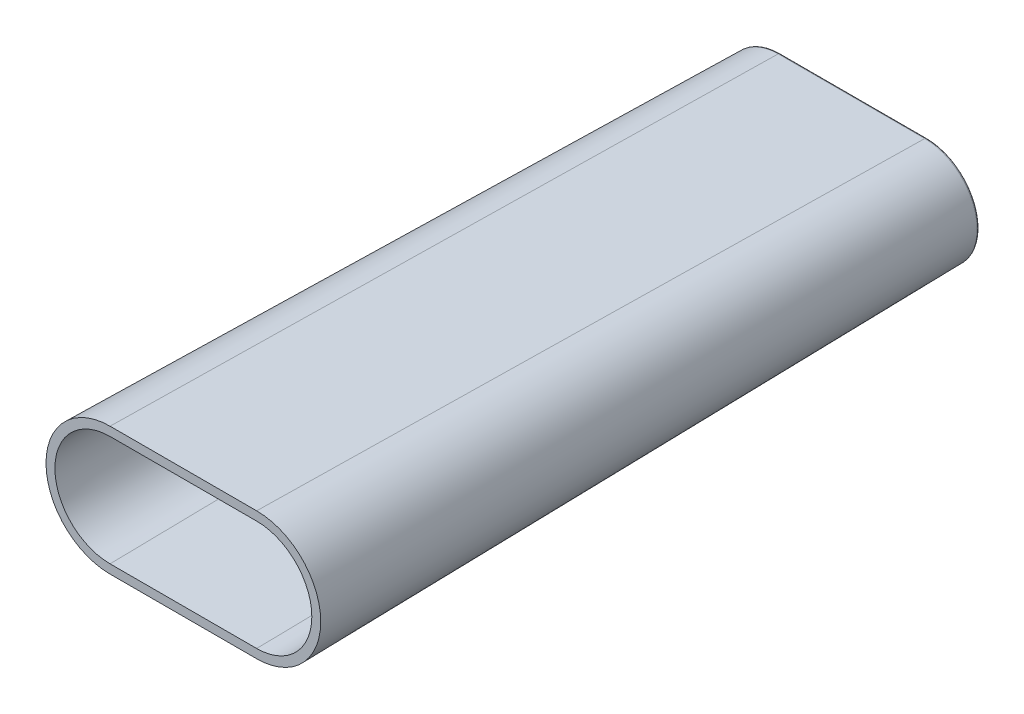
ISO-10303-21;
HEADER;
FILE_DESCRIPTION(('STEP AP214'),'2;1');
FILE_NAME('part.step','',(''),(''),'','','');
FILE_SCHEMA(('AUTOMOTIVE_DESIGN { 1 0 10303 214 1 1 1 1 }'));
ENDSEC;
DATA;
#1=APPLICATION_CONTEXT('core data for automotive mechanical design processes');
#2=APPLICATION_PROTOCOL_DEFINITION('international standard','automotive_design',2000,#1);
#3=PRODUCT_CONTEXT('',#1,'mechanical');
#4=PRODUCT('Part','Part','',(#3));
#5=PRODUCT_RELATED_PRODUCT_CATEGORY('part','',(#4));
#6=PRODUCT_DEFINITION_FORMATION('','',#4);
#7=PRODUCT_DEFINITION_CONTEXT('part definition',#1,'design');
#8=PRODUCT_DEFINITION('design','',#6,#7);
#9=PRODUCT_DEFINITION_SHAPE('','',#8);
#10=(LENGTH_UNIT() NAMED_UNIT(*) SI_UNIT(.MILLI.,.METRE.));
#11=(NAMED_UNIT(*) PLANE_ANGLE_UNIT() SI_UNIT($,.RADIAN.));
#12=(NAMED_UNIT(*) SI_UNIT($,.STERADIAN.) SOLID_ANGLE_UNIT());
#13=UNCERTAINTY_MEASURE_WITH_UNIT(LENGTH_MEASURE(1.E-05),#10,'distance_accuracy_value','');
#14=(GEOMETRIC_REPRESENTATION_CONTEXT(3) GLOBAL_UNCERTAINTY_ASSIGNED_CONTEXT((#13)) GLOBAL_UNIT_ASSIGNED_CONTEXT((#10,
#11,#12)) REPRESENTATION_CONTEXT('',''));
#15=CARTESIAN_POINT('',(0.,0.,0.));
#16=DIRECTION('',(0.,0.,1.));
#17=DIRECTION('',(1.,0.,0.));
#18=AXIS2_PLACEMENT_3D('',#15,#16,#17);
#19=CARTESIAN_POINT('',(-7.,-4.15012945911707,0.014834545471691));
#20=DIRECTION('',(0.,-0.999847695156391,-0.0174524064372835));
#21=DIRECTION('',(0.,0.0174524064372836,-0.999847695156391));
#22=AXIS2_PLACEMENT_3D('',#19,#20,#21);
#23=PLANE('',#22);
#24=DIRECTION('',(-1.,0.,0.));
#25=VECTOR('',#24,1.);
#26=CARTESIAN_POINT('',(-0.500000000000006,-5.00242283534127,48.8426893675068));
#27=LINE('',#26,#25);
#28=CARTESIAN_POINT('',(-0.500000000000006,-5.00242283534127,48.8426893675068));
#29=VERTEX_POINT('',#28);
#30=CARTESIAN_POINT('',(0.499999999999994,-5.00242283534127,48.8426893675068));
#31=VERTEX_POINT('',#30);
#32=EDGE_CURVE('E169',#29,#31,#27,.F.);
#33=ORIENTED_EDGE('',*,*,#32,.F.);
#34=DIRECTION('',(0.,0.0174524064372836,-0.999847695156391));
#35=VECTOR('',#34,1.);
#36=CARTESIAN_POINT('',(-0.500000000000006,-5.01679211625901,49.6659049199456));
#37=LINE('',#36,#35);
#38=CARTESIAN_POINT('',(-0.5,-4.16470732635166,0.849999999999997));
#39=VERTEX_POINT('',#38);
#40=EDGE_CURVE('E170',#39,#29,#37,.F.);
#41=ORIENTED_EDGE('',*,*,#40,.F.);
#42=DIRECTION('',(-1.,0.,0.));
#43=VECTOR('',#42,1.);
#44=CARTESIAN_POINT('',(-7.,-4.16470732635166,0.85));
#45=LINE('',#44,#43);
#46=CARTESIAN_POINT('',(-7.,-4.16470732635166,0.85));
#47=VERTEX_POINT('',#46);
#48=EDGE_CURVE('E217',#47,#39,#45,.F.);
#49=ORIENTED_EDGE('',*,*,#48,.F.);
#50=DIRECTION('',(0.,0.0174524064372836,-0.999847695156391));
#51=VECTOR('',#50,1.);
#52=CARTESIAN_POINT('',(-7.,-4.15012945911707,0.014834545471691));
#53=LINE('',#52,#51);
#54=CARTESIAN_POINT('',(-7.,-5.26699467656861,64.));
#55=VERTEX_POINT('',#54);
#56=EDGE_CURVE('E207',#55,#47,#53,.T.);
#57=ORIENTED_EDGE('',*,*,#56,.F.);
#58=DIRECTION('',(-1.,0.,0.));
#59=VECTOR('',#58,1.);
#60=CARTESIAN_POINT('',(-7.,-5.26699467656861,64.));
#61=LINE('',#60,#59);
#62=CARTESIAN_POINT('',(7.,-5.26699467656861,64.));
#63=VERTEX_POINT('',#62);
#64=EDGE_CURVE('E231',#55,#63,#61,.F.);
#65=ORIENTED_EDGE('',*,*,#64,.T.);
#66=DIRECTION('',(0.,-0.0174524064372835,0.999847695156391));
#67=VECTOR('',#66,1.);
#68=CARTESIAN_POINT('',(7.,-4.15012945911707,0.014834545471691));
#69=LINE('',#68,#67);
#70=CARTESIAN_POINT('',(7.,-4.16470732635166,0.85));
#71=VERTEX_POINT('',#70);
#72=EDGE_CURVE('E211',#63,#71,#69,.F.);
#73=ORIENTED_EDGE('',*,*,#72,.T.);
#74=CARTESIAN_POINT('',(0.5,-4.16470732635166,0.85));
#75=VERTEX_POINT('',#74);
#76=EDGE_CURVE('E206',#75,#71,#45,.F.);
#77=ORIENTED_EDGE('',*,*,#76,.F.);
#78=DIRECTION('',(0.,-0.0174524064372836,0.999847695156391));
#79=VECTOR('',#78,1.);
#80=CARTESIAN_POINT('',(0.5,-4.17958692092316,1.70245140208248));
#81=LINE('',#80,#79);
#82=EDGE_CURVE('E52',#31,#75,#81,.F.);
#83=ORIENTED_EDGE('',*,*,#82,.F.);
#84=EDGE_LOOP('',(#33,#41,#49,#57,#65,#73,#77,#83));
#85=FACE_BOUND('',#84,.T.);
#86=ADVANCED_FACE('F35',(#85),#23,.F.);
#87=CARTESIAN_POINT('',(7.,4.15012945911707,0.014834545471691));
#88=DIRECTION('',(0.,0.999847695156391,-0.0174524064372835));
#89=DIRECTION('',(0.,0.0174524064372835,0.999847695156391));
#90=AXIS2_PLACEMENT_3D('',#87,#88,#89);
#91=PLANE('',#90);
#92=DIRECTION('',(1.,0.,0.));
#93=VECTOR('',#92,1.);
#94=CARTESIAN_POINT('',(7.,4.16470732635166,0.85));
#95=LINE('',#94,#93);
#96=CARTESIAN_POINT('',(-0.5,4.16470732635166,0.849999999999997));
#97=VERTEX_POINT('',#96);
#98=CARTESIAN_POINT('',(-7.,4.16470732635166,0.85));
#99=VERTEX_POINT('',#98);
#100=EDGE_CURVE('E224',#97,#99,#95,.F.);
#101=ORIENTED_EDGE('',*,*,#100,.F.);
#102=DIRECTION('',(0.,-0.0174524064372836,-0.999847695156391));
#103=VECTOR('',#102,1.);
#104=CARTESIAN_POINT('',(-0.500000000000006,5.00242283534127,48.8426893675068));
#105=LINE('',#104,#103);
#106=CARTESIAN_POINT('',(-0.500000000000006,5.00242283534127,48.8426893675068));
#107=VERTEX_POINT('',#106);
#108=EDGE_CURVE('E183',#107,#97,#105,.T.);
#109=ORIENTED_EDGE('',*,*,#108,.F.);
#110=DIRECTION('',(-1.,0.,0.));
#111=VECTOR('',#110,1.);
#112=CARTESIAN_POINT('',(-0.500000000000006,5.00242283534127,48.8426893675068));
#113=LINE('',#112,#111);
#114=CARTESIAN_POINT('',(0.499999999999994,5.00242283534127,48.8426893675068));
#115=VERTEX_POINT('',#114);
#116=EDGE_CURVE('E166',#115,#107,#113,.T.);
#117=ORIENTED_EDGE('',*,*,#116,.F.);
#118=DIRECTION('',(0.,0.0174524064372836,0.999847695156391));
#119=VECTOR('',#118,1.);
#120=CARTESIAN_POINT('',(0.5,4.16470732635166,0.849999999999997));
#121=LINE('',#120,#119);
#122=CARTESIAN_POINT('',(0.5,4.16470732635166,0.849999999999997));
#123=VERTEX_POINT('',#122);
#124=EDGE_CURVE('E174',#123,#115,#121,.T.);
#125=ORIENTED_EDGE('',*,*,#124,.F.);
#126=CARTESIAN_POINT('',(7.,4.16470732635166,0.85));
#127=VERTEX_POINT('',#126);
#128=EDGE_CURVE('E227',#127,#123,#95,.F.);
#129=ORIENTED_EDGE('',*,*,#128,.F.);
#130=DIRECTION('',(0.,0.0174524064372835,0.999847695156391));
#131=VECTOR('',#130,1.);
#132=CARTESIAN_POINT('',(7.,4.15012945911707,0.014834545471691));
#133=LINE('',#132,#131);
#134=CARTESIAN_POINT('',(7.,5.26699467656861,64.));
#135=VERTEX_POINT('',#134);
#136=EDGE_CURVE('E215',#135,#127,#133,.F.);
#137=ORIENTED_EDGE('',*,*,#136,.F.);
#138=DIRECTION('',(1.,0.,0.));
#139=VECTOR('',#138,1.);
#140=CARTESIAN_POINT('',(7.,5.26699467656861,64.));
#141=LINE('',#140,#139);
#142=CARTESIAN_POINT('',(-7.,5.26699467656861,64.));
#143=VERTEX_POINT('',#142);
#144=EDGE_CURVE('E216',#135,#143,#141,.F.);
#145=ORIENTED_EDGE('',*,*,#144,.T.);
#146=DIRECTION('',(0.,0.0174524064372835,0.999847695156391));
#147=VECTOR('',#146,1.);
#148=CARTESIAN_POINT('',(-7.,4.15012945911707,0.014834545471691));
#149=LINE('',#148,#147);
#150=EDGE_CURVE('E212',#143,#99,#149,.F.);
#151=ORIENTED_EDGE('',*,*,#150,.T.);
#152=EDGE_LOOP('',(#101,#109,#117,#125,#129,#137,#145,#151));
#153=FACE_BOUND('',#152,.T.);
#154=ADVANCED_FACE('F182',(#153),#91,.F.);
#155=CARTESIAN_POINT('',(-7.,0.,0.85));
#156=DIRECTION('',(0.,0.,1.));
#157=DIRECTION('',(1.,0.,0.));
#158=AXIS2_PLACEMENT_3D('',#155,#156,#157);
#159=PLANE('',#158);
#160=ORIENTED_EDGE('',*,*,#48,.T.);
#161=DIRECTION('',(0.,1.,0.));
#162=VECTOR('',#161,1.);
#163=CARTESIAN_POINT('',(-0.5,-53.0164950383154,0.849999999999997));
#164=LINE('',#163,#162);
#165=EDGE_CURVE('E189',#39,#97,#164,.T.);
#166=ORIENTED_EDGE('',*,*,#165,.T.);
#167=ORIENTED_EDGE('',*,*,#100,.T.);
#168=CARTESIAN_POINT('',(-7.,0.,0.85));
#169=DIRECTION('',(0.,0.,1.));
#170=DIRECTION('',(1.,0.,0.));
#171=AXIS2_PLACEMENT_3D('',#168,#169,#170);
#172=CIRCLE('',#171,4.16470732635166);
#173=EDGE_CURVE('E203',#99,#47,#172,.T.);
#174=ORIENTED_EDGE('',*,*,#173,.T.);
#175=EDGE_LOOP('',(#160,#166,#167,#174));
#176=FACE_BOUND('',#175,.T.);
#177=ADVANCED_FACE('F339',(#176),#159,.T.);
#178=ORIENTED_EDGE('',*,*,#128,.T.);
#179=DIRECTION('',(0.,1.,0.));
#180=VECTOR('',#179,1.);
#181=CARTESIAN_POINT('',(0.5,-53.0164950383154,0.849999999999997));
#182=LINE('',#181,#180);
#183=EDGE_CURVE('E176',#75,#123,#182,.T.);
#184=ORIENTED_EDGE('',*,*,#183,.F.);
#185=ORIENTED_EDGE('',*,*,#76,.T.);
#186=CARTESIAN_POINT('',(7.,0.,0.85));
#187=DIRECTION('',(0.,0.,1.));
#188=DIRECTION('',(1.,0.,0.));
#189=AXIS2_PLACEMENT_3D('',#186,#187,#188);
#190=CIRCLE('',#189,4.16470732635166);
#191=EDGE_CURVE('E220',#71,#127,#190,.T.);
#192=ORIENTED_EDGE('',*,*,#191,.T.);
#193=EDGE_LOOP('',(#178,#184,#185,#192));
#194=FACE_BOUND('',#193,.T.);
#195=ADVANCED_FACE('F344',(#194),#159,.T.);
#196=CARTESIAN_POINT('',(-7.,0.,0.));
#197=DIRECTION('',(0.,0.,1.));
#198=DIRECTION('',(1.,0.,0.));
#199=AXIS2_PLACEMENT_3D('',#196,#197,#198);
#200=CONICAL_SURFACE('',#199,5.,0.0174532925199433);
#201=DIRECTION('',(0.,0.0174524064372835,0.999847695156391));
#202=VECTOR('',#201,1.);
#203=CARTESIAN_POINT('',(-7.,5.,0.));
#204=LINE('',#203,#202);
#205=CARTESIAN_POINT('',(-7.,6.11712415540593,64.));
#206=VERTEX_POINT('',#205);
#207=CARTESIAN_POINT('',(-7.,5.00343008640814,0.196509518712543));
#208=VERTEX_POINT('',#207);
#209=EDGE_CURVE('E245',#206,#208,#204,.F.);
#210=ORIENTED_EDGE('',*,*,#209,.T.);
#211=CARTESIAN_POINT('',(-7.,0.,0.196509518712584));
#212=DIRECTION('',(0.,0.,-1.));
#213=DIRECTION('',(-1.,0.,0.));
#214=AXIS2_PLACEMENT_3D('',#211,#212,#213);
#215=CIRCLE('',#214,5.00343008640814);
#216=CARTESIAN_POINT('',(-7.,-5.00343008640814,0.196509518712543));
#217=VERTEX_POINT('',#216);
#218=EDGE_CURVE('E11',#208,#217,#215,.F.);
#219=ORIENTED_EDGE('',*,*,#218,.T.);
#220=DIRECTION('',(0.,-0.0174524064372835,0.999847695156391));
#221=VECTOR('',#220,1.);
#222=CARTESIAN_POINT('',(-7.,-5.,0.));
#223=LINE('',#222,#221);
#224=CARTESIAN_POINT('',(-7.,-6.11712415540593,64.));
#225=VERTEX_POINT('',#224);
#226=EDGE_CURVE('E246',#225,#217,#223,.F.);
#227=ORIENTED_EDGE('',*,*,#226,.F.);
#228=CARTESIAN_POINT('',(-7.,0.,64.));
#229=DIRECTION('',(0.,0.,1.));
#230=DIRECTION('',(1.,0.,0.));
#231=AXIS2_PLACEMENT_3D('',#228,#229,#230);
#232=CIRCLE('',#231,6.11712415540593);
#233=EDGE_CURVE('E210',#206,#225,#232,.T.);
#234=ORIENTED_EDGE('',*,*,#233,.F.);
#235=EDGE_LOOP('',(#210,#219,#227,#234));
#236=FACE_BOUND('',#235,.T.);
#237=ADVANCED_FACE('F354',(#236),#200,.T.);
#238=CARTESIAN_POINT('',(-7.,-5.,0.));
#239=DIRECTION('',(0.,-0.999847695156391,-0.0174524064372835));
#240=DIRECTION('',(0.,0.0174524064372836,-0.999847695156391));
#241=AXIS2_PLACEMENT_3D('',#238,#239,#240);
#242=PLANE('',#241);
#243=ORIENTED_EDGE('',*,*,#226,.T.);
#244=DIRECTION('',(1.,0.,0.));
#245=VECTOR('',#244,1.);
#246=CARTESIAN_POINT('',(-7.,-5.00343008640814,0.196509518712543));
#247=LINE('',#246,#245);
#248=CARTESIAN_POINT('',(7.,-5.00343008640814,0.196509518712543));
#249=VERTEX_POINT('',#248);
#250=EDGE_CURVE('E249',#217,#249,#247,.T.);
#251=ORIENTED_EDGE('',*,*,#250,.T.);
#252=DIRECTION('',(0.,-0.0174524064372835,0.999847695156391));
#253=VECTOR('',#252,1.);
#254=CARTESIAN_POINT('',(7.,-5.,0.));
#255=LINE('',#254,#253);
#256=CARTESIAN_POINT('',(7.,-6.11712415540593,64.));
#257=VERTEX_POINT('',#256);
#258=EDGE_CURVE('E250',#257,#249,#255,.F.);
#259=ORIENTED_EDGE('',*,*,#258,.F.);
#260=DIRECTION('',(-1.,0.,0.));
#261=VECTOR('',#260,1.);
#262=CARTESIAN_POINT('',(-7.,-6.11712415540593,64.));
#263=LINE('',#262,#261);
#264=EDGE_CURVE('E239',#225,#257,#263,.F.);
#265=ORIENTED_EDGE('',*,*,#264,.F.);
#266=EDGE_LOOP('',(#243,#251,#259,#265));
#267=FACE_BOUND('',#266,.T.);
#268=ADVANCED_FACE('F357',(#267),#242,.T.);
#269=CARTESIAN_POINT('',(7.,0.,0.));
#270=DIRECTION('',(0.,0.,1.));
#271=DIRECTION('',(-1.,0.,0.));
#272=AXIS2_PLACEMENT_3D('',#269,#270,#271);
#273=CONICAL_SURFACE('',#272,5.,0.0174532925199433);
#274=ORIENTED_EDGE('',*,*,#258,.T.);
#275=CARTESIAN_POINT('',(7.,0.,0.196509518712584));
#276=DIRECTION('',(0.,0.,-1.));
#277=DIRECTION('',(-1.,0.,0.));
#278=AXIS2_PLACEMENT_3D('',#275,#276,#277);
#279=CIRCLE('',#278,5.00343008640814);
#280=CARTESIAN_POINT('',(7.,5.00343008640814,0.196509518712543));
#281=VERTEX_POINT('',#280);
#282=EDGE_CURVE('E276',#249,#281,#279,.F.);
#283=ORIENTED_EDGE('',*,*,#282,.T.);
#284=DIRECTION('',(0.,0.0174524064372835,0.999847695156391));
#285=VECTOR('',#284,1.);
#286=CARTESIAN_POINT('',(7.,5.,0.));
#287=LINE('',#286,#285);
#288=CARTESIAN_POINT('',(7.,6.11712415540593,64.));
#289=VERTEX_POINT('',#288);
#290=EDGE_CURVE('E252',#289,#281,#287,.F.);
#291=ORIENTED_EDGE('',*,*,#290,.F.);
#292=CARTESIAN_POINT('',(7.,0.,64.));
#293=DIRECTION('',(0.,0.,1.));
#294=DIRECTION('',(1.,0.,0.));
#295=AXIS2_PLACEMENT_3D('',#292,#293,#294);
#296=CIRCLE('',#295,6.11712415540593);
#297=EDGE_CURVE('E241',#257,#289,#296,.T.);
#298=ORIENTED_EDGE('',*,*,#297,.F.);
#299=EDGE_LOOP('',(#274,#283,#291,#298));
#300=FACE_BOUND('',#299,.T.);
#301=ADVANCED_FACE('F361',(#300),#273,.T.);
#302=CARTESIAN_POINT('',(7.,5.,0.));
#303=DIRECTION('',(0.,0.999847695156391,-0.0174524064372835));
#304=DIRECTION('',(0.,0.0174524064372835,0.999847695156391));
#305=AXIS2_PLACEMENT_3D('',#302,#303,#304);
#306=PLANE('',#305);
#307=ORIENTED_EDGE('',*,*,#290,.T.);
#308=DIRECTION('',(-1.,0.,0.));
#309=VECTOR('',#308,1.);
#310=CARTESIAN_POINT('',(7.,5.00343008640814,0.196509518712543));
#311=LINE('',#310,#309);
#312=EDGE_CURVE('E44',#281,#208,#311,.T.);
#313=ORIENTED_EDGE('',*,*,#312,.T.);
#314=ORIENTED_EDGE('',*,*,#209,.F.);
#315=DIRECTION('',(1.,0.,0.));
#316=VECTOR('',#315,1.);
#317=CARTESIAN_POINT('',(7.,6.11712415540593,64.));
#318=LINE('',#317,#316);
#319=EDGE_CURVE('E243',#289,#206,#318,.F.);
#320=ORIENTED_EDGE('',*,*,#319,.F.);
#321=EDGE_LOOP('',(#307,#313,#314,#320));
#322=FACE_BOUND('',#321,.T.);
#323=ADVANCED_FACE('F349',(#322),#306,.T.);
#324=CARTESIAN_POINT('',(-7.,0.,64.));
#325=DIRECTION('',(0.,0.,1.));
#326=DIRECTION('',(1.,0.,0.));
#327=AXIS2_PLACEMENT_3D('',#324,#325,#326);
#328=PLANE('',#327);
#329=CARTESIAN_POINT('',(-7.,0.,64.));
#330=DIRECTION('',(0.,0.,1.));
#331=DIRECTION('',(1.,0.,0.));
#332=AXIS2_PLACEMENT_3D('',#329,#330,#331);
#333=CIRCLE('',#332,5.26699467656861);
#334=EDGE_CURVE('E229',#143,#55,#333,.T.);
#335=ORIENTED_EDGE('',*,*,#334,.F.);
#336=ORIENTED_EDGE('',*,*,#144,.F.);
#337=CARTESIAN_POINT('',(7.,0.,64.));
#338=DIRECTION('',(0.,0.,1.));
#339=DIRECTION('',(1.,0.,0.));
#340=AXIS2_PLACEMENT_3D('',#337,#338,#339);
#341=CIRCLE('',#340,5.26699467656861);
#342=EDGE_CURVE('E233',#63,#135,#341,.T.);
#343=ORIENTED_EDGE('',*,*,#342,.F.);
#344=ORIENTED_EDGE('',*,*,#64,.F.);
#345=EDGE_LOOP('',(#335,#336,#343,#344));
#346=FACE_BOUND('',#345,.T.);
#347=ORIENTED_EDGE('',*,*,#233,.T.);
#348=ORIENTED_EDGE('',*,*,#264,.T.);
#349=ORIENTED_EDGE('',*,*,#297,.T.);
#350=ORIENTED_EDGE('',*,*,#319,.T.);
#351=EDGE_LOOP('',(#347,#348,#349,#350));
#352=FACE_BOUND('',#351,.T.);
#353=ADVANCED_FACE('F346',(#346,#352),#328,.T.);
#354=CARTESIAN_POINT('',(-7.,0.,0.));
#355=DIRECTION('',(0.,0.,1.));
#356=DIRECTION('',(1.,0.,0.));
#357=AXIS2_PLACEMENT_3D('',#354,#355,#356);
#358=PLANE('',#357);
#359=CARTESIAN_POINT('',(7.,0.,0.));
#360=DIRECTION('',(0.,0.,1.));
#361=DIRECTION('',(1.,0.,0.));
#362=AXIS2_PLACEMENT_3D('',#359,#360,#361);
#363=CIRCLE('',#362,4.80346054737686);
#364=CARTESIAN_POINT('',(7.,4.80346054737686,0.));
#365=VERTEX_POINT('',#364);
#366=CARTESIAN_POINT('',(7.,-4.80346054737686,0.));
#367=VERTEX_POINT('',#366);
#368=EDGE_CURVE('E271',#365,#367,#363,.F.);
#369=ORIENTED_EDGE('',*,*,#368,.T.);
#370=DIRECTION('',(-1.,0.,0.));
#371=VECTOR('',#370,1.);
#372=CARTESIAN_POINT('',(-7.,-4.80346054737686,0.));
#373=LINE('',#372,#371);
#374=CARTESIAN_POINT('',(-7.,-4.80346054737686,0.));
#375=VERTEX_POINT('',#374);
#376=EDGE_CURVE('E273',#367,#375,#373,.T.);
#377=ORIENTED_EDGE('',*,*,#376,.T.);
#378=CARTESIAN_POINT('',(-7.,0.,0.));
#379=DIRECTION('',(0.,0.,1.));
#380=DIRECTION('',(1.,0.,0.));
#381=AXIS2_PLACEMENT_3D('',#378,#379,#380);
#382=CIRCLE('',#381,4.80346054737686);
#383=CARTESIAN_POINT('',(-7.,4.80346054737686,0.));
#384=VERTEX_POINT('',#383);
#385=EDGE_CURVE('E267',#375,#384,#382,.F.);
#386=ORIENTED_EDGE('',*,*,#385,.T.);
#387=DIRECTION('',(1.,0.,0.));
#388=VECTOR('',#387,1.);
#389=CARTESIAN_POINT('',(-7.,4.80346054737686,0.));
#390=LINE('',#389,#388);
#391=EDGE_CURVE('E269',#384,#365,#390,.T.);
#392=ORIENTED_EDGE('',*,*,#391,.T.);
#393=EDGE_LOOP('',(#369,#377,#386,#392));
#394=FACE_BOUND('',#393,.T.);
#395=DIRECTION('',(-1.,0.,0.));
#396=VECTOR('',#395,1.);
#397=CARTESIAN_POINT('',(-7.,-3.7,0.));
#398=LINE('',#397,#396);
#399=CARTESIAN_POINT('',(-7.,-3.7,0.));
#400=VERTEX_POINT('',#399);
#401=CARTESIAN_POINT('',(7.,-3.7,0.));
#402=VERTEX_POINT('',#401);
#403=EDGE_CURVE('E262',#400,#402,#398,.F.);
#404=ORIENTED_EDGE('',*,*,#403,.T.);
#405=CARTESIAN_POINT('',(7.,0.,0.));
#406=DIRECTION('',(0.,0.,1.));
#407=DIRECTION('',(1.,0.,0.));
#408=AXIS2_PLACEMENT_3D('',#405,#406,#407);
#409=CIRCLE('',#408,3.7);
#410=CARTESIAN_POINT('',(7.,3.7,0.));
#411=VERTEX_POINT('',#410);
#412=EDGE_CURVE('E264',#402,#411,#409,.T.);
#413=ORIENTED_EDGE('',*,*,#412,.T.);
#414=DIRECTION('',(1.,0.,0.));
#415=VECTOR('',#414,1.);
#416=CARTESIAN_POINT('',(-7.,3.7,0.));
#417=LINE('',#416,#415);
#418=CARTESIAN_POINT('',(-7.,3.7,0.));
#419=VERTEX_POINT('',#418);
#420=EDGE_CURVE('E258',#411,#419,#417,.F.);
#421=ORIENTED_EDGE('',*,*,#420,.T.);
#422=CARTESIAN_POINT('',(-7.,0.,0.));
#423=DIRECTION('',(0.,0.,1.));
#424=DIRECTION('',(1.,0.,0.));
#425=AXIS2_PLACEMENT_3D('',#422,#423,#424);
#426=CIRCLE('',#425,3.7);
#427=EDGE_CURVE('E260',#419,#400,#426,.T.);
#428=ORIENTED_EDGE('',*,*,#427,.T.);
#429=EDGE_LOOP('',(#404,#413,#421,#428));
#430=FACE_BOUND('',#429,.T.);
#431=ADVANCED_FACE('F308',(#394,#430),#358,.F.);
#432=CARTESIAN_POINT('',(-7.,0.,0.014834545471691));
#433=DIRECTION('',(0.,0.,1.));
#434=DIRECTION('',(1.,0.,0.));
#435=AXIS2_PLACEMENT_3D('',#432,#433,#434);
#436=CONICAL_SURFACE('',#435,4.15012945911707,0.0174532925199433);
#437=ORIENTED_EDGE('',*,*,#173,.F.);
#438=ORIENTED_EDGE('',*,*,#150,.F.);
#439=ORIENTED_EDGE('',*,*,#334,.T.);
#440=ORIENTED_EDGE('',*,*,#56,.T.);
#441=EDGE_LOOP('',(#437,#438,#439,#440));
#442=FACE_BOUND('',#441,.T.);
#443=ADVANCED_FACE('F328',(#442),#436,.F.);
#444=CARTESIAN_POINT('',(7.,0.,0.014834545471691));
#445=DIRECTION('',(0.,0.,1.));
#446=DIRECTION('',(-1.,0.,0.));
#447=AXIS2_PLACEMENT_3D('',#444,#445,#446);
#448=CONICAL_SURFACE('',#447,4.15012945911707,0.0174532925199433);
#449=ORIENTED_EDGE('',*,*,#191,.F.);
#450=ORIENTED_EDGE('',*,*,#72,.F.);
#451=ORIENTED_EDGE('',*,*,#342,.T.);
#452=ORIENTED_EDGE('',*,*,#136,.T.);
#453=EDGE_LOOP('',(#449,#450,#451,#452));
#454=FACE_BOUND('',#453,.T.);
#455=ADVANCED_FACE('F319',(#454),#448,.F.);
#456=CARTESIAN_POINT('',(-7.,0.,0.2));
#457=DIRECTION('',(0.,0.,-1.));
#458=DIRECTION('',(0.,1.,0.));
#459=AXIS2_PLACEMENT_3D('',#456,#457,#458);
#460=PLANE('',#459);
#461=CARTESIAN_POINT('',(-7.,0.,0.2));
#462=DIRECTION('',(0.,0.,-1.));
#463=DIRECTION('',(0.,1.,0.));
#464=AXIS2_PLACEMENT_3D('',#461,#462,#463);
#465=CIRCLE('',#464,3.5);
#466=CARTESIAN_POINT('',(-7.,-3.5,0.2));
#467=VERTEX_POINT('',#466);
#468=CARTESIAN_POINT('',(-7.,3.5,0.2));
#469=VERTEX_POINT('',#468);
#470=EDGE_CURVE('E193',#467,#469,#465,.T.);
#471=ORIENTED_EDGE('',*,*,#470,.T.);
#472=DIRECTION('',(1.,0.,0.));
#473=VECTOR('',#472,1.);
#474=CARTESIAN_POINT('',(-7.,3.5,0.2));
#475=LINE('',#474,#473);
#476=CARTESIAN_POINT('',(7.,3.5,0.2));
#477=VERTEX_POINT('',#476);
#478=EDGE_CURVE('E195',#469,#477,#475,.T.);
#479=ORIENTED_EDGE('',*,*,#478,.T.);
#480=CARTESIAN_POINT('',(7.,0.,0.2));
#481=DIRECTION('',(0.,0.,-1.));
#482=DIRECTION('',(0.,1.,0.));
#483=AXIS2_PLACEMENT_3D('',#480,#481,#482);
#484=CIRCLE('',#483,3.5);
#485=CARTESIAN_POINT('',(7.,-3.5,0.2));
#486=VERTEX_POINT('',#485);
#487=EDGE_CURVE('E198',#477,#486,#484,.T.);
#488=ORIENTED_EDGE('',*,*,#487,.T.);
#489=DIRECTION('',(-1.,0.,0.));
#490=VECTOR('',#489,1.);
#491=CARTESIAN_POINT('',(7.,-3.5,0.2));
#492=LINE('',#491,#490);
#493=EDGE_CURVE('E201',#486,#467,#492,.T.);
#494=ORIENTED_EDGE('',*,*,#493,.T.);
#495=EDGE_LOOP('',(#471,#479,#488,#494));
#496=FACE_BOUND('',#495,.T.);
#497=ADVANCED_FACE('F316',(#496),#460,.T.);
#498=CARTESIAN_POINT('',(7.,4.80346054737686,0.2));
#499=DIRECTION('',(1.,0.,0.));
#500=DIRECTION('',(0.,0.,-1.));
#501=AXIS2_PLACEMENT_3D('',#498,#499,#500);
#502=CYLINDRICAL_SURFACE('',#501,0.2);
#503=CARTESIAN_POINT('',(7.,4.80346054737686,0.2));
#504=DIRECTION('',(1.,0.,0.));
#505=DIRECTION('',(0.,0.,-1.));
#506=AXIS2_PLACEMENT_3D('',#503,#504,#505);
#507=CIRCLE('',#506,0.2);
#508=EDGE_CURVE('E283',#365,#281,#507,.T.);
#509=ORIENTED_EDGE('',*,*,#508,.F.);
#510=ORIENTED_EDGE('',*,*,#391,.F.);
#511=CARTESIAN_POINT('',(-7.,4.80346054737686,0.2));
#512=DIRECTION('',(-1.,0.,0.));
#513=DIRECTION('',(0.,0.,1.));
#514=AXIS2_PLACEMENT_3D('',#511,#512,#513);
#515=CIRCLE('',#514,0.2);
#516=EDGE_CURVE('E196',#208,#384,#515,.T.);
#517=ORIENTED_EDGE('',*,*,#516,.F.);
#518=ORIENTED_EDGE('',*,*,#312,.F.);
#519=EDGE_LOOP('',(#509,#510,#517,#518));
#520=FACE_BOUND('',#519,.T.);
#521=ADVANCED_FACE('F318',(#520),#502,.T.);
#522=CARTESIAN_POINT('',(-7.,0.,0.2));
#523=DIRECTION('',(0.,0.,1.));
#524=DIRECTION('',(1.,0.,0.));
#525=AXIS2_PLACEMENT_3D('',#522,#523,#524);
#526=TOROIDAL_SURFACE('',#525,4.80346054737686,0.2);
#527=ORIENTED_EDGE('',*,*,#516,.T.);
#528=ORIENTED_EDGE('',*,*,#385,.F.);
#529=CARTESIAN_POINT('',(-7.,-4.80346054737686,0.2));
#530=DIRECTION('',(1.,0.,0.));
#531=DIRECTION('',(0.,0.,-1.));
#532=AXIS2_PLACEMENT_3D('',#529,#530,#531);
#533=CIRCLE('',#532,0.2);
#534=EDGE_CURVE('E281',#217,#375,#533,.T.);
#535=ORIENTED_EDGE('',*,*,#534,.F.);
#536=ORIENTED_EDGE('',*,*,#218,.F.);
#537=EDGE_LOOP('',(#527,#528,#535,#536));
#538=FACE_BOUND('',#537,.T.);
#539=ADVANCED_FACE('F325',(#538),#526,.T.);
#540=CARTESIAN_POINT('',(7.,0.,0.2));
#541=DIRECTION('',(0.,0.,1.));
#542=DIRECTION('',(1.,0.,0.));
#543=AXIS2_PLACEMENT_3D('',#540,#541,#542);
#544=TOROIDAL_SURFACE('',#543,4.80346054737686,0.2);
#545=ORIENTED_EDGE('',*,*,#508,.T.);
#546=ORIENTED_EDGE('',*,*,#282,.F.);
#547=CARTESIAN_POINT('',(7.,-4.80346054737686,0.2));
#548=DIRECTION('',(-1.,0.,0.));
#549=DIRECTION('',(0.,0.,1.));
#550=AXIS2_PLACEMENT_3D('',#547,#548,#549);
#551=CIRCLE('',#550,0.2);
#552=EDGE_CURVE('E279',#367,#249,#551,.T.);
#553=ORIENTED_EDGE('',*,*,#552,.F.);
#554=ORIENTED_EDGE('',*,*,#368,.F.);
#555=EDGE_LOOP('',(#545,#546,#553,#554));
#556=FACE_BOUND('',#555,.T.);
#557=ADVANCED_FACE('F371',(#556),#544,.T.);
#558=CARTESIAN_POINT('',(-7.,-4.80346054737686,0.2));
#559=DIRECTION('',(-1.,0.,0.));
#560=DIRECTION('',(0.,0.,1.));
#561=AXIS2_PLACEMENT_3D('',#558,#559,#560);
#562=CYLINDRICAL_SURFACE('',#561,0.2);
#563=ORIENTED_EDGE('',*,*,#534,.T.);
#564=ORIENTED_EDGE('',*,*,#376,.F.);
#565=ORIENTED_EDGE('',*,*,#552,.T.);
#566=ORIENTED_EDGE('',*,*,#250,.F.);
#567=EDGE_LOOP('',(#563,#564,#565,#566));
#568=FACE_BOUND('',#567,.T.);
#569=ADVANCED_FACE('F368',(#568),#562,.T.);
#570=CARTESIAN_POINT('',(-7.,0.,0.2));
#571=DIRECTION('',(0.,0.,1.));
#572=DIRECTION('',(1.,0.,0.));
#573=AXIS2_PLACEMENT_3D('',#570,#571,#572);
#574=TOROIDAL_SURFACE('',#573,3.7,0.2);
#575=CARTESIAN_POINT('',(-7.,-3.7,0.2));
#576=DIRECTION('',(1.,0.,0.));
#577=DIRECTION('',(0.,0.,-1.));
#578=AXIS2_PLACEMENT_3D('',#575,#576,#577);
#579=CIRCLE('',#578,0.2);
#580=EDGE_CURVE('E291',#400,#467,#579,.T.);
#581=ORIENTED_EDGE('',*,*,#580,.F.);
#582=ORIENTED_EDGE('',*,*,#427,.F.);
#583=CARTESIAN_POINT('',(-7.,3.7,0.2));
#584=DIRECTION('',(1.,0.,0.));
#585=DIRECTION('',(0.,0.,-1.));
#586=AXIS2_PLACEMENT_3D('',#583,#584,#585);
#587=CIRCLE('',#586,0.2);
#588=EDGE_CURVE('E39',#469,#419,#587,.T.);
#589=ORIENTED_EDGE('',*,*,#588,.F.);
#590=ORIENTED_EDGE('',*,*,#470,.F.);
#591=EDGE_LOOP('',(#581,#582,#589,#590));
#592=FACE_BOUND('',#591,.T.);
#593=ADVANCED_FACE('F37',(#592),#574,.T.);
#594=CARTESIAN_POINT('',(-7.,3.7,0.2));
#595=DIRECTION('',(1.,0.,0.));
#596=DIRECTION('',(0.,1.,0.));
#597=AXIS2_PLACEMENT_3D('',#594,#595,#596);
#598=CYLINDRICAL_SURFACE('',#597,0.2);
#599=ORIENTED_EDGE('',*,*,#588,.T.);
#600=ORIENTED_EDGE('',*,*,#420,.F.);
#601=CARTESIAN_POINT('',(7.,3.7,0.2));
#602=DIRECTION('',(1.,0.,0.));
#603=DIRECTION('',(0.,0.,-1.));
#604=AXIS2_PLACEMENT_3D('',#601,#602,#603);
#605=CIRCLE('',#604,0.2);
#606=EDGE_CURVE('E290',#477,#411,#605,.T.);
#607=ORIENTED_EDGE('',*,*,#606,.F.);
#608=ORIENTED_EDGE('',*,*,#478,.F.);
#609=EDGE_LOOP('',(#599,#600,#607,#608));
#610=FACE_BOUND('',#609,.T.);
#611=ADVANCED_FACE('F302',(#610),#598,.T.);
#612=CARTESIAN_POINT('',(7.,-3.7,0.2));
#613=DIRECTION('',(-1.,0.,0.));
#614=DIRECTION('',(0.,-1.,0.));
#615=AXIS2_PLACEMENT_3D('',#612,#613,#614);
#616=CYLINDRICAL_SURFACE('',#615,0.2);
#617=ORIENTED_EDGE('',*,*,#580,.T.);
#618=ORIENTED_EDGE('',*,*,#493,.F.);
#619=CARTESIAN_POINT('',(7.,-3.7,0.2));
#620=DIRECTION('',(1.,0.,0.));
#621=DIRECTION('',(0.,0.,-1.));
#622=AXIS2_PLACEMENT_3D('',#619,#620,#621);
#623=CIRCLE('',#622,0.2);
#624=EDGE_CURVE('E288',#402,#486,#623,.T.);
#625=ORIENTED_EDGE('',*,*,#624,.F.);
#626=ORIENTED_EDGE('',*,*,#403,.F.);
#627=EDGE_LOOP('',(#617,#618,#625,#626));
#628=FACE_BOUND('',#627,.T.);
#629=ADVANCED_FACE('F314',(#628),#616,.T.);
#630=CARTESIAN_POINT('',(7.,0.,0.2));
#631=DIRECTION('',(0.,0.,1.));
#632=DIRECTION('',(1.,0.,0.));
#633=AXIS2_PLACEMENT_3D('',#630,#631,#632);
#634=TOROIDAL_SURFACE('',#633,3.7,0.2);
#635=ORIENTED_EDGE('',*,*,#606,.T.);
#636=ORIENTED_EDGE('',*,*,#412,.F.);
#637=ORIENTED_EDGE('',*,*,#624,.T.);
#638=ORIENTED_EDGE('',*,*,#487,.F.);
#639=EDGE_LOOP('',(#635,#636,#637,#638));
#640=FACE_BOUND('',#639,.T.);
#641=ADVANCED_FACE('F312',(#640),#634,.T.);
#642=CARTESIAN_POINT('',(-0.500000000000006,-52.1787795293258,48.8426893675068));
#643=DIRECTION('',(1.,0.,0.));
#644=DIRECTION('',(0.,0.,-1.));
#645=AXIS2_PLACEMENT_3D('',#642,#643,#644);
#646=PLANE('',#645);
#647=ORIENTED_EDGE('',*,*,#165,.F.);
#648=ORIENTED_EDGE('',*,*,#40,.T.);
#649=DIRECTION('',(0.,1.,0.));
#650=VECTOR('',#649,1.);
#651=CARTESIAN_POINT('',(-0.500000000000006,-52.1787795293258,48.8426893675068));
#652=LINE('',#651,#650);
#653=EDGE_CURVE('E171',#29,#107,#652,.T.);
#654=ORIENTED_EDGE('',*,*,#653,.T.);
#655=ORIENTED_EDGE('',*,*,#108,.T.);
#656=EDGE_LOOP('',(#647,#648,#654,#655));
#657=FACE_BOUND('',#656,.T.);
#658=ADVANCED_FACE('F381',(#657),#646,.F.);
#659=CARTESIAN_POINT('',(-0.500000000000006,-52.1787795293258,48.8426893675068));
#660=DIRECTION('',(0.,0.,-1.));
#661=DIRECTION('',(-1.,0.,0.));
#662=AXIS2_PLACEMENT_3D('',#659,#660,#661);
#663=PLANE('',#662);
#664=ORIENTED_EDGE('',*,*,#653,.F.);
#665=ORIENTED_EDGE('',*,*,#32,.T.);
#666=DIRECTION('',(0.,1.,0.));
#667=VECTOR('',#666,1.);
#668=CARTESIAN_POINT('',(0.499999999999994,-52.1787795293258,48.8426893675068));
#669=LINE('',#668,#667);
#670=EDGE_CURVE('E162',#31,#115,#669,.T.);
#671=ORIENTED_EDGE('',*,*,#670,.T.);
#672=ORIENTED_EDGE('',*,*,#116,.T.);
#673=EDGE_LOOP('',(#664,#665,#671,#672));
#674=FACE_BOUND('',#673,.T.);
#675=ADVANCED_FACE('F164',(#674),#663,.F.);
#676=CARTESIAN_POINT('',(0.5,-53.0164950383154,0.849999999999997));
#677=DIRECTION('',(-1.,0.,0.));
#678=DIRECTION('',(0.,0.,1.));
#679=AXIS2_PLACEMENT_3D('',#676,#677,#678);
#680=PLANE('',#679);
#681=ORIENTED_EDGE('',*,*,#670,.F.);
#682=ORIENTED_EDGE('',*,*,#82,.T.);
#683=ORIENTED_EDGE('',*,*,#183,.T.);
#684=ORIENTED_EDGE('',*,*,#124,.T.);
#685=EDGE_LOOP('',(#681,#682,#683,#684));
#686=FACE_BOUND('',#685,.T.);
#687=ADVANCED_FACE('F175',(#686),#680,.F.);
#688=CLOSED_SHELL('',(#86,#154,#177,#195,#237,#268,#301,#323,#353,#431,#443,#455,#497,#521,#539,
#557,#569,#593,#611,#629,#641,#658,#675,#687));
#689=MANIFOLD_SOLID_BREP('B2',#688);
#690=ADVANCED_BREP_SHAPE_REPRESENTATION('',(#18,#689),#14);
#691=SHAPE_DEFINITION_REPRESENTATION(#9,#690);
ENDSEC;
END-ISO-10303-21;
